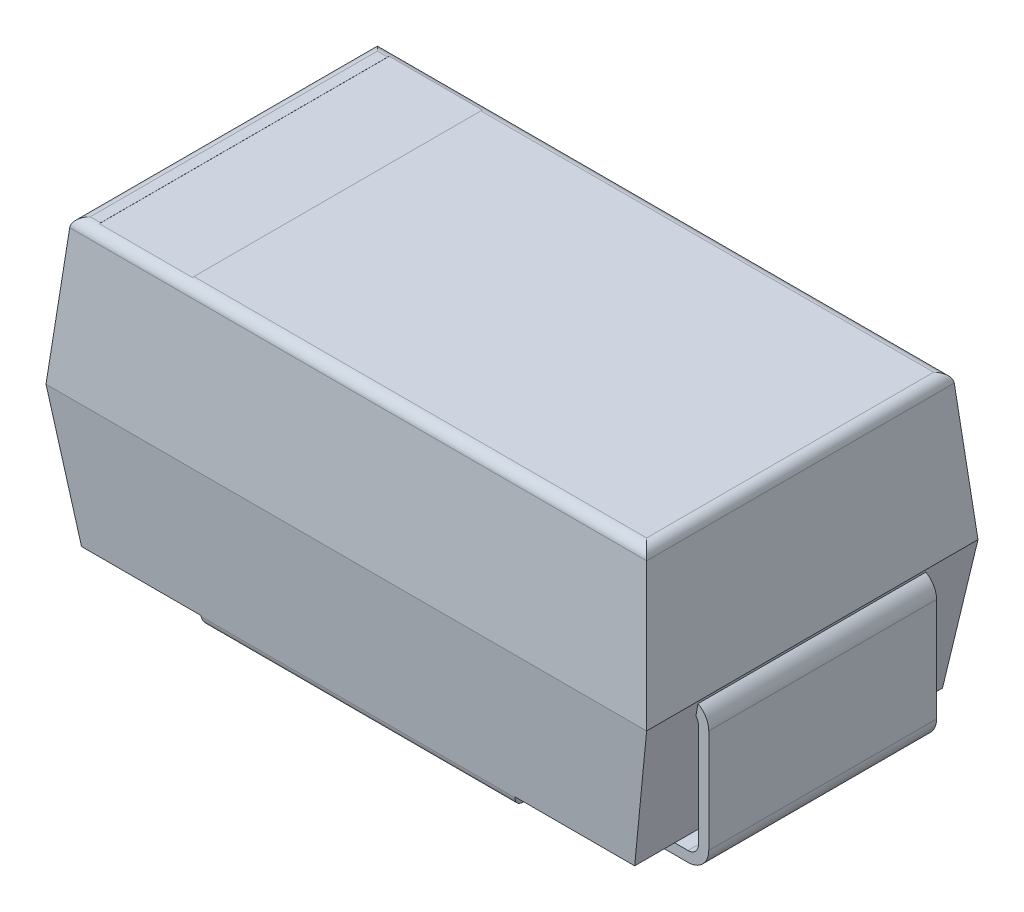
from build123d import *

# Parameters (mm, degrees)
EXTRUDE_START            = -1.1
EXTRUDE_1_DEPTH          = 2.2
EXTRUDE_3_DEPTH          = 1.6
CUT_EXTRUDE_1_DEPTH      = 5.404543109
CUT_EXTRUDE_1_DEPTH_BACK = 5.404543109
SKETCH_4_OUTSIDE_W       = 6.67
SKETCH_4_OUTSIDE_H       = 6.27
CUT_EXTRUDE_2_DEPTH      = 5.404543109
CUT_EXTRUDE_2_DEPTH_BACK = 5.404543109
SKETCH_5_W               = 0.9
SKETCH_5_H               = 0.001


with BuildPart() as part:
    # Sketch 1 → Extrude 1 (new body)
    with BuildSketch(Plane.XY.offset(EXTRUDE_START)):
        with BuildLine():
            Line((-1.7, 0.1), (-2.8, 0.1))
            ThreePointArc((-2.8, 0.1), (-2.870710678, 0.129289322), (-2.9, 0.2))
            Line((-2.9, 0.2), (-2.9, 1.2))
            ThreePointArc((-2.9, 1.2), (-2.870710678, 1.270710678), (-2.8, 1.3))
            Line((-2.8, 1.3), (2.8, 1.3))
            ThreePointArc((2.8, 1.3), (2.870710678, 1.270710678), (2.9, 1.2))
            Line((2.9, 1.2), (2.9, 0.2))
            ThreePointArc((2.9, 0.2), (2.870710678, 0.129289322), (2.8, 0.1))
            Line((2.8, 0.1), (1.7, 0.1))
            Line((1.7, 0.1), (1.7, 0))
            Line((1.7, 0), (2.8, 0))
            ThreePointArc((2.8, 0), (2.941421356, 0.058578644), (3, 0.2))
            Line((3, 0.2), (3, 1.2))
            ThreePointArc((3, 1.2), (2.941421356, 1.341421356), (2.8, 1.4))
            Line((2.8, 1.4), (-2.8, 1.4))
            ThreePointArc((-2.8, 1.4), (-2.941421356, 1.341421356), (-3, 1.2))
            Line((-3, 1.2), (-3, 0.2))
            ThreePointArc((-3, 0.2), (-2.941421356, 0.058578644), (-2.8, 0))
            Line((-2.8, 0), (-1.7, 0))
            Line((-1.7, 0), (-1.7, 0.1))
        make_face()
    extrude(amount=EXTRUDE_1_DEPTH)

    # Sketch 3 → Extrude 3 (add, symmetric)
    with BuildSketch(Plane.XY):
        with BuildLine():
            Line((2.685882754, 2.8), (-2.685882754, 2.8))
            ThreePointArc((-2.685882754, 2.8), (-2.753441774, 2.773727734), (-2.785502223, 2.708715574))
            Line((-2.785502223, 2.708715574), (-2.9, 1.4))
            Line((-2.9, 1.4), (-2.670774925, 0.1))
            Line((-2.670774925, 0.1), (-1.517632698, 0.1))
            Line((-1.517632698, 0.1), (-1.5, 0))
            Line((-1.5, 0), (1.5, 0))
            Line((1.5, 0), (1.517632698, 0.1))
            Line((1.517632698, 0.1), (2.670774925, 0.1))
            Line((2.670774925, 0.1), (2.9, 1.4))
            Line((2.9, 1.4), (2.785502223, 2.708715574))
            ThreePointArc((2.785502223, 2.708715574), (2.753441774, 2.773727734), (2.685882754, 2.8))
        make_face()
    extrude(amount=EXTRUDE_3_DEPTH, both=True)

    # Sketch 4 outside → Cut-Extrude 1 (cut, two sides: drawn at the far end of the back side and taken through both)
    with BuildSketch(Plane(origin=(0, 0, 0), x_dir=(0, 0, -1), z_dir=(1, 0, 0)).offset(-CUT_EXTRUDE_1_DEPTH_BACK)):
        with Locations((0, 1.4)):
            Rectangle(SKETCH_4_OUTSIDE_W, SKETCH_4_OUTSIDE_H)
        with BuildLine():
            Line((1.6, 1.4), (1.485502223, 2.708715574))
            ThreePointArc((1.485502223, 2.708715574), (1.453441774, 2.773727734), (1.385882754, 2.8))
            Line((1.385882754, 2.8), (-1.385882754, 2.8))
            ThreePointArc((-1.385882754, 2.8), (-1.453441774, 2.773727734), (-1.485502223, 2.708715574))
            Line((-1.485502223, 2.708715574), (-1.6, 1.4))
            Line((-1.6, 1.4), (-1.485502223, 0.091284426))
            ThreePointArc((-1.485502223, 0.091284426), (-1.453441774, 0.026272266), (-1.385882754, 0))
            Line((-1.385882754, 0), (1.385882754, 0))
            ThreePointArc((1.385882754, 0), (1.453441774, 0.026272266), (1.485502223, 0.091284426))
            Line((1.485502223, 0.091284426), (1.6, 1.4))
        make_face(mode=Mode.SUBTRACT)
    extrude(amount=CUT_EXTRUDE_1_DEPTH + CUT_EXTRUDE_1_DEPTH_BACK, mode=Mode.SUBTRACT)

    # Sketch 5 → Cut-Extrude 2 (cut, two sides: drawn at the far end of the back side and taken through both)
    with BuildSketch(Plane.XY.offset(-CUT_EXTRUDE_2_DEPTH_BACK)):
        with Locations((-2.135882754, 2.7995)):
            Rectangle(SKETCH_5_W, SKETCH_5_H)
    extrude(amount=CUT_EXTRUDE_2_DEPTH + CUT_EXTRUDE_2_DEPTH_BACK, mode=Mode.SUBTRACT)


solid = part.part
